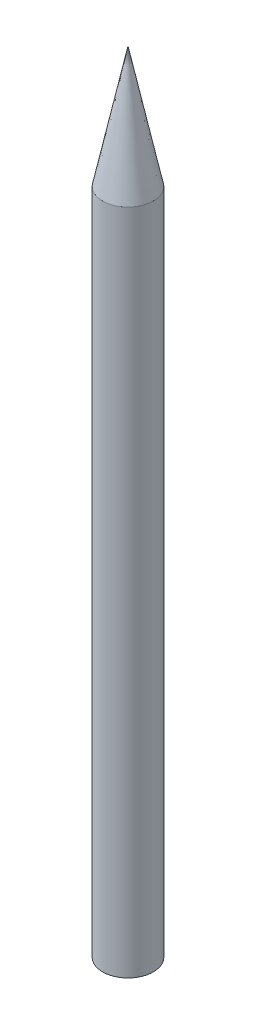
from build123d import *

# Parameters (mm, degrees)
SKETCH1_R           = 5.3
BOSS_EXTRUDE1_DEPTH = 139.7


with BuildPart() as part:
    # Sketch1 → Boss-Extrude1 (new body)
    with BuildSketch(Plane(origin=(0, 0, 0), x_dir=(1, 0, 0), z_dir=(0, 1, 0))):
        with Locations(Location((0, 0, 0), (0, 0, 270))):
            Circle(SKETCH1_R)
    extrude(amount=BOSS_EXTRUDE1_DEPTH)


with BuildPart() as body_2:
    # Sketch2 → Revolve1 (revolve)
    with BuildSketch(Plane(origin=(0, 0, 0), x_dir=(0, 0, -1), z_dir=(1, 0, 0))):
        Polygon((0, 139.741936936), (5.3, 139.7), (0, 165.141936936), align=None)
    revolve(axis=Axis((0, 0, 0), (0, 1, 0)))


solid = Compound([part.part, body_2.part])
